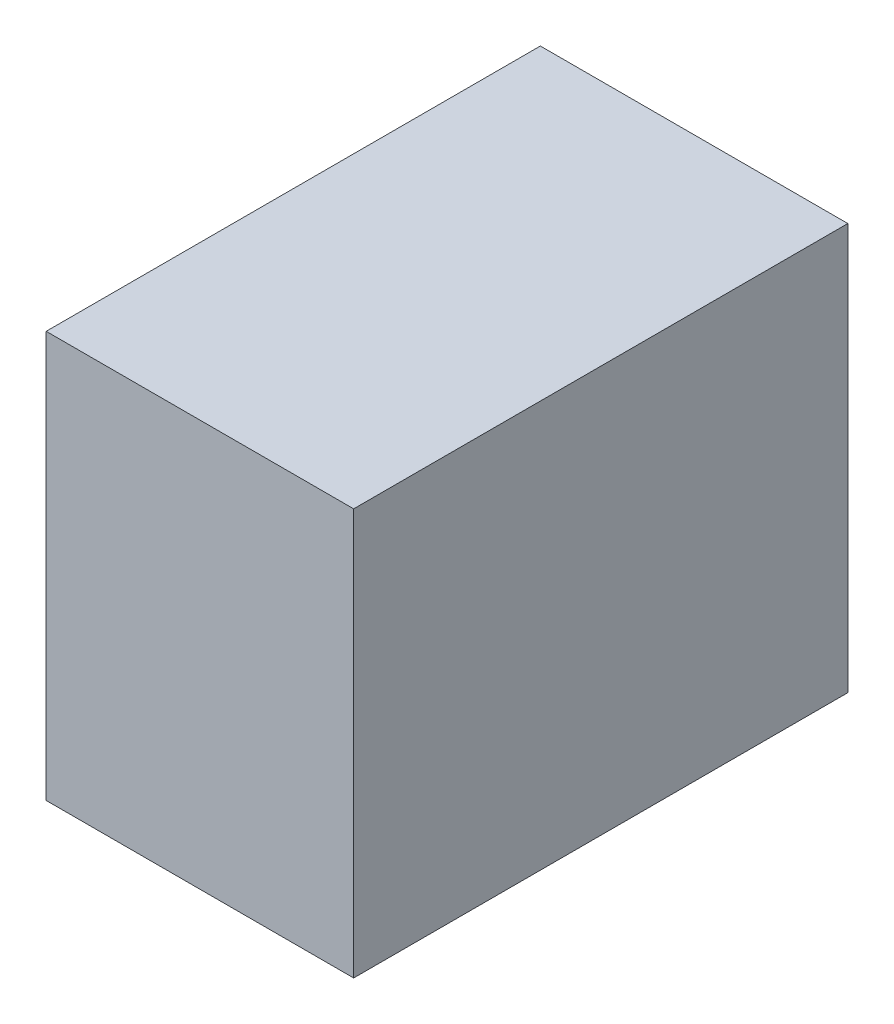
from build123d import *

# Parameters (mm, degrees)
SKETCH1_W           = 28
SKETCH1_H           = 37
BOSS_EXTRUDE1_DEPTH = 45


with BuildPart() as part:
    # Sketch1 → Boss-Extrude1 (new body)
    with BuildSketch(Plane.XY):
        with Locations((16.9, 14.638329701)):
            Rectangle(SKETCH1_W, SKETCH1_H)
    extrude(amount=BOSS_EXTRUDE1_DEPTH)


solid = part.part
